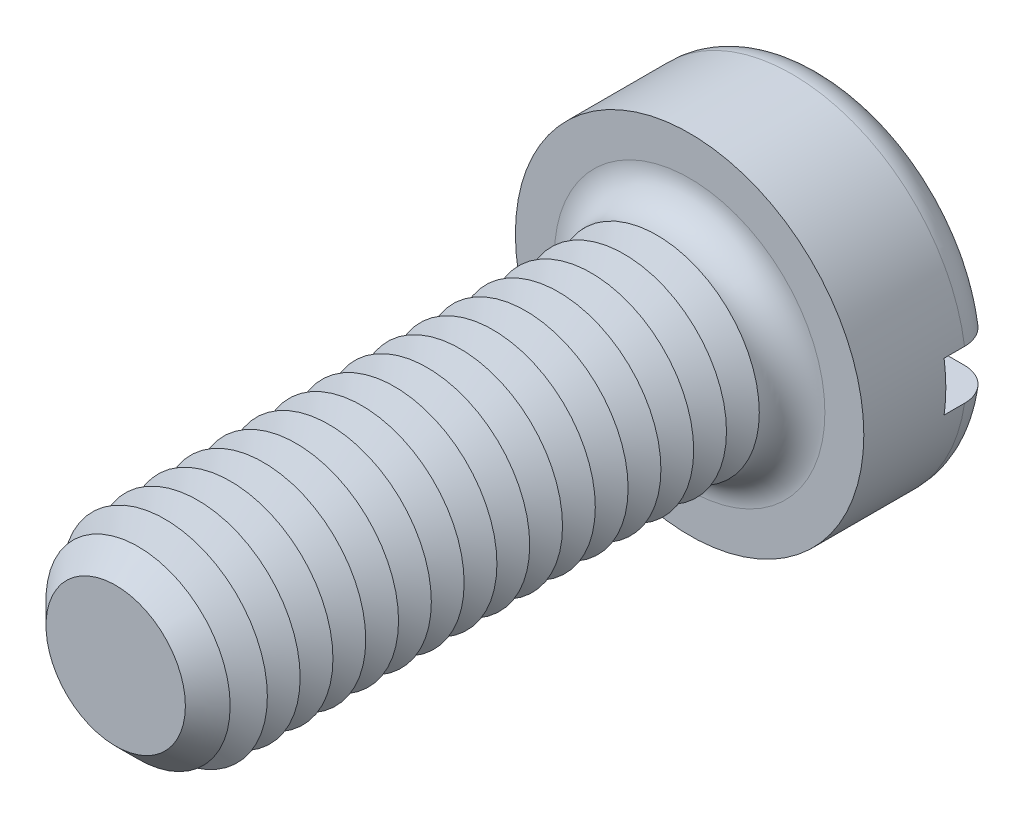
ISO-10303-21;
HEADER;
FILE_DESCRIPTION(('STEP AP214'),'2;1');
FILE_NAME('part.step','',(''),(''),'','','');
FILE_SCHEMA(('AUTOMOTIVE_DESIGN { 1 0 10303 214 1 1 1 1 }'));
ENDSEC;
DATA;
#1=APPLICATION_CONTEXT('core data for automotive mechanical design processes');
#2=APPLICATION_PROTOCOL_DEFINITION('international standard','automotive_design',2000,#1);
#3=PRODUCT_CONTEXT('',#1,'mechanical');
#4=PRODUCT('Part','Part','',(#3));
#5=PRODUCT_RELATED_PRODUCT_CATEGORY('part','',(#4));
#6=PRODUCT_DEFINITION_FORMATION('','',#4);
#7=PRODUCT_DEFINITION_CONTEXT('part definition',#1,'design');
#8=PRODUCT_DEFINITION('design','',#6,#7);
#9=PRODUCT_DEFINITION_SHAPE('','',#8);
#10=(LENGTH_UNIT() NAMED_UNIT(*) SI_UNIT(.MILLI.,.METRE.));
#11=(NAMED_UNIT(*) PLANE_ANGLE_UNIT() SI_UNIT($,.RADIAN.));
#12=(NAMED_UNIT(*) SI_UNIT($,.STERADIAN.) SOLID_ANGLE_UNIT());
#13=UNCERTAINTY_MEASURE_WITH_UNIT(LENGTH_MEASURE(1.E-05),#10,'distance_accuracy_value','');
#14=(GEOMETRIC_REPRESENTATION_CONTEXT(3) GLOBAL_UNCERTAINTY_ASSIGNED_CONTEXT((#13)) GLOBAL_UNIT_ASSIGNED_CONTEXT((#10,
#11,#12)) REPRESENTATION_CONTEXT('',''));
#15=CARTESIAN_POINT('',(0.,0.,0.));
#16=DIRECTION('',(0.,0.,1.));
#17=DIRECTION('',(1.,0.,0.));
#18=AXIS2_PLACEMENT_3D('',#15,#16,#17);
#19=CARTESIAN_POINT('',(0.,0.,-3.3));
#20=DIRECTION('',(0.,0.,1.));
#21=DIRECTION('',(1.,0.,0.));
#22=AXIS2_PLACEMENT_3D('',#19,#20,#21);
#23=PLANE('',#22);
#24=CARTESIAN_POINT('',(0.,0.,-3.3));
#25=DIRECTION('',(0.,0.,1.));
#26=DIRECTION('',(1.,0.,0.));
#27=AXIS2_PLACEMENT_3D('',#24,#25,#26);
#28=CIRCLE('',#27,3.45);
#29=CARTESIAN_POINT('',(-3.39742549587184,0.6,-3.3));
#30=VERTEX_POINT('',#29);
#31=CARTESIAN_POINT('',(3.39742549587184,0.6,-3.3));
#32=VERTEX_POINT('',#31);
#33=EDGE_CURVE('E116',#30,#32,#28,.F.);
#34=ORIENTED_EDGE('',*,*,#33,.T.);
#35=DIRECTION('',(1.,0.,0.));
#36=VECTOR('',#35,1.);
#37=CARTESIAN_POINT('',(-4.25,0.600000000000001,-3.3));
#38=LINE('',#37,#36);
#39=EDGE_CURVE('E111',#30,#32,#38,.T.);
#40=ORIENTED_EDGE('',*,*,#39,.F.);
#41=EDGE_LOOP('',(#34,#40));
#42=FACE_BOUND('',#41,.T.);
#43=ADVANCED_FACE('F39',(#42),#23,.F.);
#44=CARTESIAN_POINT('',(0.,0.,-2.5));
#45=DIRECTION('',(0.,0.,1.));
#46=DIRECTION('',(1.,0.,0.));
#47=AXIS2_PLACEMENT_3D('',#44,#45,#46);
#48=TOROIDAL_SURFACE('',#47,3.45,0.8);
#49=CARTESIAN_POINT('',(-4.06369072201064,0.600000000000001,-2.95537828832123));
#50=CARTESIAN_POINT('',(-4.03774340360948,0.600000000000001,-2.99245078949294));
#51=CARTESIAN_POINT('',(-4.00861849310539,0.600000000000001,-3.02734231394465));
#52=CARTESIAN_POINT('',(-3.94488199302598,0.600000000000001,-3.0917502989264));
#53=CARTESIAN_POINT('',(-3.91026320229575,0.600000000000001,-3.12125959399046));
#54=CARTESIAN_POINT('',(-3.83660561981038,0.600000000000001,-3.17403695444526));
#55=CARTESIAN_POINT('',(-3.79757117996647,0.6,-3.19731109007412));
#56=CARTESIAN_POINT('',(-3.71618817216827,0.6,-3.23703443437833));
#57=CARTESIAN_POINT('',(-3.67384041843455,0.6,-3.25348531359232));
#58=CARTESIAN_POINT('',(-3.58661930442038,0.6,-3.2792758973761));
#59=CARTESIAN_POINT('',(-3.54172669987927,0.6,-3.288550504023));
#60=CARTESIAN_POINT('',(-3.45102322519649,0.6,-3.29952632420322));
#61=CARTESIAN_POINT('',(-3.40521225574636,0.6,-3.30122671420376));
#62=CARTESIAN_POINT('',(-3.31340831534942,0.6,-3.29701196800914));
#63=CARTESIAN_POINT('',(-3.26741940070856,0.6,-3.29100823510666));
#64=CARTESIAN_POINT('',(-3.17708556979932,0.6,-3.27141469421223));
#65=CARTESIAN_POINT('',(-3.13274074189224,0.6,-3.25782447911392));
#66=CARTESIAN_POINT('',(-3.0466814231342,0.6,-3.22332549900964));
#67=CARTESIAN_POINT('',(-3.00498444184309,0.6,-3.20237301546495));
#68=CARTESIAN_POINT('',(-2.92572251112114,0.6,-3.15372961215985));
#69=CARTESIAN_POINT('',(-2.88815755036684,0.6,-3.12603871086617));
#70=CARTESIAN_POINT('',(-2.81847654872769,0.6,-3.06483322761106));
#71=CARTESIAN_POINT('',(-2.78633186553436,0.6,-3.03135128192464));
#72=CARTESIAN_POINT('',(-2.72824805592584,0.6,-2.95937651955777));
#73=CARTESIAN_POINT('',(-2.70230829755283,0.6,-2.92088421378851));
#74=CARTESIAN_POINT('',(-2.65791262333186,0.6,-2.84074227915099));
#75=CARTESIAN_POINT('',(-2.63932560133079,0.6,-2.79916531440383));
#76=CARTESIAN_POINT('',(-2.60958432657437,0.6,-2.7134333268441));
#77=CARTESIAN_POINT('',(-2.59842889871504,0.6,-2.66927871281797));
#78=CARTESIAN_POINT('',(-2.58411140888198,0.6,-2.58073966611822));
#79=CARTESIAN_POINT('',(-2.58077086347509,0.6,-2.5363840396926));
#80=CARTESIAN_POINT('',(-2.58167367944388,0.6,-2.44775208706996));
#81=CARTESIAN_POINT('',(-2.58591644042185,0.6,-2.40347575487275));
#82=CARTESIAN_POINT('',(-2.60175154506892,0.6,-2.31675105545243));
#83=CARTESIAN_POINT('',(-2.61326489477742,0.6,-2.27428821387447));
#84=CARTESIAN_POINT('',(-2.6431863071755,0.6,-2.19186794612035));
#85=CARTESIAN_POINT('',(-2.66159465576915,0.6,-2.15191062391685));
#86=CARTESIAN_POINT('',(-2.70494650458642,0.6,-2.07517696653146));
#87=CARTESIAN_POINT('',(-2.72995486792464,0.6,-2.03843731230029));
#88=CARTESIAN_POINT('',(-2.7856570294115,0.6,-1.96955746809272));
#89=CARTESIAN_POINT('',(-2.81635145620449,0.6,-1.93741778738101));
#90=CARTESIAN_POINT('',(-2.88329572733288,0.6,-1.87788048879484));
#91=CARTESIAN_POINT('',(-2.91965530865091,0.6,-1.85060625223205));
#92=CARTESIAN_POINT('',(-2.9963658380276,0.6,-1.80241044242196));
#93=CARTESIAN_POINT('',(-3.03671721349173,0.6,-1.78148955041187));
#94=CARTESIAN_POINT('',(-3.12111125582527,0.6,-1.74619829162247));
#95=CARTESIAN_POINT('',(-3.16521020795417,0.6,-1.73196239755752));
#96=CARTESIAN_POINT('',(-3.25516487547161,0.6,-1.71103773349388));
#97=CARTESIAN_POINT('',(-3.30102068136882,0.6,-1.70434935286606));
#98=CARTESIAN_POINT('',(-3.39352689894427,0.6,-1.69870104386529));
#99=CARTESIAN_POINT('',(-3.44018061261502,0.6,-1.69979487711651));
#100=CARTESIAN_POINT('',(-3.53263583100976,0.6,-1.70983959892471));
#101=CARTESIAN_POINT('',(-3.57843734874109,0.6,-1.71879036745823));
#102=CARTESIAN_POINT('',(-3.66763544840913,0.6,-1.74426972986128));
#103=CARTESIAN_POINT('',(-3.71104292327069,0.6,-1.76076015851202));
#104=CARTESIAN_POINT('',(-3.79442616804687,0.6,-1.80087686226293));
#105=CARTESIAN_POINT('',(-3.83440212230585,0.600000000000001,-1.82450275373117));
#106=CARTESIAN_POINT('',(-3.90929765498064,0.600000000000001,-1.87793548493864));
#107=CARTESIAN_POINT('',(-3.94426963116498,0.600000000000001,-1.90766887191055));
#108=CARTESIAN_POINT('',(-4.00864839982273,0.600000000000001,-1.9726503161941));
#109=CARTESIAN_POINT('',(-4.03805555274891,0.600000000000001,-2.00789801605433));
#110=CARTESIAN_POINT('',(-4.09009460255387,0.600000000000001,-2.08244463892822));
#111=CARTESIAN_POINT('',(-4.11280448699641,0.600000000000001,-2.12168912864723));
#112=CARTESIAN_POINT('',(-4.15124086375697,0.600000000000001,-2.2034588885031));
#113=CARTESIAN_POINT('',(-4.16696802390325,0.600000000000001,-2.24598384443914));
#114=CARTESIAN_POINT('',(-4.19085131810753,0.600000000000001,-2.33267862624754));
#115=CARTESIAN_POINT('',(-4.19907708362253,0.600000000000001,-2.37682928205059));
#116=CARTESIAN_POINT('',(-4.2079638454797,0.600000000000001,-2.46589754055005));
#117=CARTESIAN_POINT('',(-4.20862315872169,0.600000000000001,-2.51081531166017));
#118=CARTESIAN_POINT('',(-4.20236829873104,0.600000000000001,-2.59993343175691));
#119=CARTESIAN_POINT('',(-4.19548454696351,0.600000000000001,-2.64413593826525));
#120=CARTESIAN_POINT('',(-4.17439924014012,0.600000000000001,-2.73071930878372));
#121=CARTESIAN_POINT('',(-4.16020675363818,0.600000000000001,-2.77310235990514));
#122=CARTESIAN_POINT('',(-4.1318825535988,0.600000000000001,-2.83880495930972));
#123=CARTESIAN_POINT('',(-4.11991183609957,0.600000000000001,-2.86307959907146));
#124=CARTESIAN_POINT('',(-4.09356927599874,0.600000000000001,-2.91028856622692));
#125=CARTESIAN_POINT('',(-4.07919744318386,0.600000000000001,-2.9332228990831));
#126=CARTESIAN_POINT('',(-4.06369072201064,0.600000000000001,-2.95537828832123));
#127=B_SPLINE_CURVE_WITH_KNOTS('',3,(#49,#50,#51,#52,#53,#54,#55,#56,#57,#58,#59,#60,#61,#62,
#63,#64,#65,#66,#67,#68,#69,#70,#71,#72,#73,#74,#75,#76,#77,#78,#79,#80,#81,#82,#83,#84,#85,#86,
#87,#88,#89,#90,#91,#92,#93,#94,#95,#96,#97,#98,#99,#100,#101,#102,#103,#104,#105,#106,#107,
#108,#109,#110,#111,#112,#113,#114,#115,#116,#117,#118,#119,#120,#121,#122,#123,#124,#125,#126),
.UNSPECIFIED.,.T.,.F.,(4,2,2,2,2,2,2,2,2,2,2,2,2,2,2,2,2,2,2,2,2,2,2,2,2,2,2,2,2,2,2,2,2,2,2,2,
2,2,4),(0.,0.13565225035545,0.271483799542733,0.407182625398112,0.542848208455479,
0.679730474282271,0.816627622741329,0.955113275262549,1.09360635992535,1.23293614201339,
1.37226554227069,1.51083389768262,1.64938813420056,1.78534653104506,1.92128342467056,
2.0540840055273,2.18687407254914,2.31824564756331,2.44962267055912,2.58234229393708,
2.71507659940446,2.85080630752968,2.98655056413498,3.12491938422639,3.26329534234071,
3.40262816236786,3.54195885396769,3.68059194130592,3.81921757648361,3.95626453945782,
4.09330262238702,4.2286754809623,4.36403538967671,4.49812564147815,4.63224572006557,
4.76582687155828,4.89924267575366,4.98031194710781,5.0613808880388),.UNSPECIFIED.);
#128=CARTESIAN_POINT('',(-4.20743389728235,0.600000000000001,-2.50000000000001));
#129=VERTEX_POINT('',#128);
#130=EDGE_CURVE('E313',#129,#30,#127,.T.);
#131=ORIENTED_EDGE('',*,*,#130,.F.);
#132=CARTESIAN_POINT('',(0.,0.,-2.5));
#133=DIRECTION('',(0.,0.,1.));
#134=DIRECTION('',(1.,0.,0.));
#135=AXIS2_PLACEMENT_3D('',#132,#133,#134);
#136=CIRCLE('',#135,4.25);
#137=CARTESIAN_POINT('',(4.20743389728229,0.599999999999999,-2.5));
#138=VERTEX_POINT('',#137);
#139=EDGE_CURVE('E125',#138,#129,#136,.T.);
#140=ORIENTED_EDGE('',*,*,#139,.F.);
#141=CARTESIAN_POINT('',(2.63947327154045,0.6,-2.79608831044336));
#142=CARTESIAN_POINT('',(2.65655980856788,0.6,-2.83790320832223));
#143=CARTESIAN_POINT('',(2.67725642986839,0.6,-2.87828303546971));
#144=CARTESIAN_POINT('',(2.72519250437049,0.6,-2.95500233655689));
#145=CARTESIAN_POINT('',(2.75244152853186,0.6,-2.9913357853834));
#146=CARTESIAN_POINT('',(2.81257938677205,0.6,-3.05889430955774));
#147=CARTESIAN_POINT('',(2.84545995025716,0.6,-3.09012674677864));
#148=CARTESIAN_POINT('',(2.91591143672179,0.6,-3.14672620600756));
#149=CARTESIAN_POINT('',(2.95348119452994,0.6,-3.17209468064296));
#150=CARTESIAN_POINT('',(3.03291143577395,0.6,-3.21669611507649));
#151=CARTESIAN_POINT('',(3.07483186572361,0.6,-3.23582234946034));
#152=CARTESIAN_POINT('',(3.16126659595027,0.6,-3.26686062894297));
#153=CARTESIAN_POINT('',(3.2057811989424,0.6,-3.27877183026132));
#154=CARTESIAN_POINT('',(3.29669878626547,0.6,-3.29514603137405));
#155=CARTESIAN_POINT('',(3.34311773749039,0.6,-3.29952056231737));
#156=CARTESIAN_POINT('',(3.43603189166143,0.6,-3.30040472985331));
#157=CARTESIAN_POINT('',(3.48252709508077,0.6,-3.29691431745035));
#158=CARTESIAN_POINT('',(3.57420049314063,0.6,-3.28214240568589));
#159=CARTESIAN_POINT('',(3.61938038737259,0.6,-3.27087147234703));
#160=CARTESIAN_POINT('',(3.70717477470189,0.6,-3.24082890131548));
#161=CARTESIAN_POINT('',(3.74978938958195,0.6,-3.22205762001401));
#162=CARTESIAN_POINT('',(3.83078828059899,0.6,-3.17773607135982));
#163=CARTESIAN_POINT('',(3.86921015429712,0.599999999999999,-3.15225453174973));
#164=CARTESIAN_POINT('',(3.94116038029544,0.599999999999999,-3.09512672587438));
#165=CARTESIAN_POINT('',(3.9746890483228,0.599999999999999,-3.06348085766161));
#166=CARTESIAN_POINT('',(4.03545911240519,0.599999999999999,-2.99534640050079));
#167=CARTESIAN_POINT('',(4.06277344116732,0.599999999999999,-2.95892285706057));
#168=CARTESIAN_POINT('',(4.11082191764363,0.599999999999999,-2.88196698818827));
#169=CARTESIAN_POINT('',(4.13155647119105,0.599999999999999,-2.84143491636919));
#170=CARTESIAN_POINT('',(4.16563480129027,0.599999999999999,-2.75787550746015));
#171=CARTESIAN_POINT('',(4.1790544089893,0.599999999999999,-2.71487908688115));
#172=CARTESIAN_POINT('',(4.19843340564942,0.599999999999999,-2.62723691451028));
#173=CARTESIAN_POINT('',(4.20439310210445,0.599999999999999,-2.58259123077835));
#174=CARTESIAN_POINT('',(4.2086595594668,0.599999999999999,-2.49321831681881));
#175=CARTESIAN_POINT('',(4.20701422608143,0.599999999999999,-2.4484933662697));
#176=CARTESIAN_POINT('',(4.1962295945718,0.599999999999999,-2.35995704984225));
#177=CARTESIAN_POINT('',(4.18709040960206,0.599999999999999,-2.31614567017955));
#178=CARTESIAN_POINT('',(4.16160290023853,0.599999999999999,-2.23072100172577));
#179=CARTESIAN_POINT('',(4.14526169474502,0.599999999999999,-2.18910558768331));
#180=CARTESIAN_POINT('',(4.10585410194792,0.599999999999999,-2.10919238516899));
#181=CARTESIAN_POINT('',(4.08278762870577,0.599999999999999,-2.07089463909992));
#182=CARTESIAN_POINT('',(4.030487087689,0.599999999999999,-1.99851484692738));
#183=CARTESIAN_POINT('',(4.00122628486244,0.599999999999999,-1.9644521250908));
#184=CARTESIAN_POINT('',(3.93744772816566,0.599999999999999,-1.90166877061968));
#185=CARTESIAN_POINT('',(3.90292977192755,0.599999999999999,-1.87294834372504));
#186=CARTESIAN_POINT('',(3.82928727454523,0.599999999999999,-1.82137853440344));
#187=CARTESIAN_POINT('',(3.79012374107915,0.6,-1.79858484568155));
#188=CARTESIAN_POINT('',(3.70856025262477,0.6,-1.75980712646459));
#189=CARTESIAN_POINT('',(3.66616010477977,0.6,-1.74382350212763));
#190=CARTESIAN_POINT('',(3.57878495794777,0.6,-1.71891499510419));
#191=CARTESIAN_POINT('',(3.53378519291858,0.6,-1.71007699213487));
#192=CARTESIAN_POINT('',(3.44294322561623,0.6,-1.69998722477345));
#193=CARTESIAN_POINT('',(3.3971009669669,0.6,-1.69873596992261));
#194=CARTESIAN_POINT('',(3.30531297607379,0.6,-1.70385439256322));
#195=CARTESIAN_POINT('',(3.25937213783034,0.6,-1.71031204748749));
#196=CARTESIAN_POINT('',(3.1692099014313,0.6,-1.73080107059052));
#197=CARTESIAN_POINT('',(3.12498860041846,0.6,-1.74483286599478));
#198=CARTESIAN_POINT('',(3.03926209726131,0.6,-1.78018941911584));
#199=CARTESIAN_POINT('',(2.99777407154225,0.6,-1.80155586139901));
#200=CARTESIAN_POINT('',(2.91899881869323,0.6,-1.85098881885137));
#201=CARTESIAN_POINT('',(2.88171158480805,0.6,-1.8790553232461));
#202=CARTESIAN_POINT('',(2.81266124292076,0.6,-1.94094884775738));
#203=CARTESIAN_POINT('',(2.78086710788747,0.6,-1.97474122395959));
#204=CARTESIAN_POINT('',(2.72353615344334,0.6,-2.0472724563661));
#205=CARTESIAN_POINT('',(2.69799841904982,0.6,-2.08601058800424));
#206=CARTESIAN_POINT('',(2.65444718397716,0.6,-2.16655019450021));
#207=CARTESIAN_POINT('',(2.63629889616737,0.6,-2.20827875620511));
#208=CARTESIAN_POINT('',(2.60744942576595,0.6,-2.29424821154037));
#209=CARTESIAN_POINT('',(2.59674901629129,0.6,-2.33848936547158));
#210=CARTESIAN_POINT('',(2.5833312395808,0.6,-2.42714258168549));
#211=CARTESIAN_POINT('',(2.58043995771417,0.6,-2.47152848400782));
#212=CARTESIAN_POINT('',(2.58224493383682,0.6,-2.56010574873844));
#213=CARTESIAN_POINT('',(2.58693104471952,0.6,-2.60429729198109));
#214=CARTESIAN_POINT('',(2.60020046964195,0.6,-2.67311978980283));
#215=CARTESIAN_POINT('',(2.60635343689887,0.6,-2.69824441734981));
#216=CARTESIAN_POINT('',(2.62110140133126,0.6,-2.74776540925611));
#217=CARTESIAN_POINT('',(2.62969634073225,0.6,-2.77216179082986));
#218=CARTESIAN_POINT('',(2.63947327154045,0.6,-2.79608831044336));
#219=B_SPLINE_CURVE_WITH_KNOTS('',3,(#141,#142,#143,#144,#145,#146,#147,#148,#149,#150,#151,
#152,#153,#154,#155,#156,#157,#158,#159,#160,#161,#162,#163,#164,#165,#166,#167,#168,#169,#170,
#171,#172,#173,#174,#175,#176,#177,#178,#179,#180,#181,#182,#183,#184,#185,#186,#187,#188,#189,
#190,#191,#192,#193,#194,#195,#196,#197,#198,#199,#200,#201,#202,#203,#204,#205,#206,#207,#208,
#209,#210,#211,#212,#213,#214,#215,#216,#217,#218),.UNSPECIFIED.,.T.,.F.,(4,2,2,2,2,2,2,2,2,2,2,
2,2,2,2,2,2,2,2,2,2,2,2,2,2,2,2,2,2,2,2,2,2,2,2,2,2,2,4),(0.,0.135416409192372,
0.271031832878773,0.406449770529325,0.541834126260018,0.679424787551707,0.817031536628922,
0.956242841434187,1.09545501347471,1.23447850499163,1.37349539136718,1.51114036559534,
1.64877645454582,1.78470267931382,1.92062051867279,2.05510117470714,2.1895762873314,
2.32320547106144,2.45683263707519,2.59032801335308,2.72382509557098,2.85791055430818,
2.99200117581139,3.12730969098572,3.26262627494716,3.39956435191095,3.53651162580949,
3.67503685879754,3.81356990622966,3.95290367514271,4.09223721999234,4.23075602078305,
4.36925455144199,4.50509949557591,4.6409585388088,4.77376594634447,4.90639565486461,
4.98388287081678,5.06136825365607),.UNSPECIFIED.);
#220=EDGE_CURVE('E315',#32,#138,#219,.T.);
#221=ORIENTED_EDGE('',*,*,#220,.F.);
#222=ORIENTED_EDGE('',*,*,#33,.F.);
#223=EDGE_LOOP('',(#131,#140,#221,#222));
#224=FACE_BOUND('',#223,.T.);
#225=ADVANCED_FACE('F297',(#224),#48,.T.);
#226=CARTESIAN_POINT('',(0.,0.,-3.3));
#227=DIRECTION('',(0.,0.,1.));
#228=DIRECTION('',(1.,0.,0.));
#229=AXIS2_PLACEMENT_3D('',#226,#227,#228);
#230=CYLINDRICAL_SURFACE('',#229,4.25);
#231=DIRECTION('',(0.,0.,1.));
#232=VECTOR('',#231,1.);
#233=CARTESIAN_POINT('',(4.20743389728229,0.599999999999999,-3.3));
#234=LINE('',#233,#232);
#235=CARTESIAN_POINT('',(4.20743389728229,0.599999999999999,-2.));
#236=VERTEX_POINT('',#235);
#237=EDGE_CURVE('E331',#138,#236,#234,.T.);
#238=ORIENTED_EDGE('',*,*,#237,.F.);
#239=ORIENTED_EDGE('',*,*,#139,.T.);
#240=DIRECTION('',(0.,0.,1.));
#241=VECTOR('',#240,1.);
#242=CARTESIAN_POINT('',(-4.20743389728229,0.600000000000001,-3.3));
#243=LINE('',#242,#241);
#244=CARTESIAN_POINT('',(-4.20743389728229,0.600000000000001,-2.));
#245=VERTEX_POINT('',#244);
#246=EDGE_CURVE('E63',#245,#129,#243,.F.);
#247=ORIENTED_EDGE('',*,*,#246,.F.);
#248=CARTESIAN_POINT('',(0.,0.,-2.));
#249=DIRECTION('',(0.,0.,-1.));
#250=DIRECTION('',(-1.,0.,0.));
#251=AXIS2_PLACEMENT_3D('',#248,#249,#250);
#252=CIRCLE('',#251,4.25);
#253=CARTESIAN_POINT('',(-4.20743389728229,-0.599999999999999,-2.));
#254=VERTEX_POINT('',#253);
#255=EDGE_CURVE('E43',#245,#254,#252,.F.);
#256=ORIENTED_EDGE('',*,*,#255,.T.);
#257=DIRECTION('',(0.,0.,1.));
#258=VECTOR('',#257,1.);
#259=CARTESIAN_POINT('',(-4.20743389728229,-0.599999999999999,-3.3));
#260=LINE('',#259,#258);
#261=CARTESIAN_POINT('',(-4.20743389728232,-0.599999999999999,-2.5));
#262=VERTEX_POINT('',#261);
#263=EDGE_CURVE('E328',#262,#254,#260,.T.);
#264=ORIENTED_EDGE('',*,*,#263,.F.);
#265=CARTESIAN_POINT('',(4.20743389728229,-0.600000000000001,-2.5));
#266=VERTEX_POINT('',#265);
#267=EDGE_CURVE('E127',#262,#266,#136,.T.);
#268=ORIENTED_EDGE('',*,*,#267,.T.);
#269=DIRECTION('',(0.,0.,1.));
#270=VECTOR('',#269,1.);
#271=CARTESIAN_POINT('',(4.20743389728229,-0.600000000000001,-3.3));
#272=LINE('',#271,#270);
#273=CARTESIAN_POINT('',(4.20743389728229,-0.600000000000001,-2.));
#274=VERTEX_POINT('',#273);
#275=EDGE_CURVE('E55',#274,#266,#272,.F.);
#276=ORIENTED_EDGE('',*,*,#275,.F.);
#277=EDGE_CURVE('E11',#274,#236,#252,.F.);
#278=ORIENTED_EDGE('',*,*,#277,.T.);
#279=EDGE_LOOP('',(#238,#239,#247,#256,#264,#268,#276,#278));
#280=FACE_BOUND('',#279,.T.);
#281=CARTESIAN_POINT('',(0.,0.,0.));
#282=DIRECTION('',(0.,0.,1.));
#283=DIRECTION('',(1.,0.,0.));
#284=AXIS2_PLACEMENT_3D('',#281,#282,#283);
#285=CIRCLE('',#284,4.25);
#286=CARTESIAN_POINT('',(4.25,0.,0.));
#287=VERTEX_POINT('',#286);
#288=EDGE_CURVE('E334',#287,#287,#285,.T.);
#289=ORIENTED_EDGE('',*,*,#288,.F.);
#290=EDGE_LOOP('',(#289));
#291=FACE_BOUND('',#290,.T.);
#292=ADVANCED_FACE('F293',(#280,#291),#230,.T.);
#293=CARTESIAN_POINT('',(3.39742549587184,-0.6,-3.3));
#294=VERTEX_POINT('',#293);
#295=CARTESIAN_POINT('',(-3.39742549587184,-0.6,-3.3));
#296=VERTEX_POINT('',#295);
#297=EDGE_CURVE('E109',#294,#296,#28,.F.);
#298=ORIENTED_EDGE('',*,*,#297,.T.);
#299=DIRECTION('',(-1.,0.,0.));
#300=VECTOR('',#299,1.);
#301=CARTESIAN_POINT('',(-4.25,-0.599999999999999,-3.3));
#302=LINE('',#301,#300);
#303=EDGE_CURVE('E96',#294,#296,#302,.T.);
#304=ORIENTED_EDGE('',*,*,#303,.F.);
#305=EDGE_LOOP('',(#298,#304));
#306=FACE_BOUND('',#305,.T.);
#307=ADVANCED_FACE('F108',(#306),#23,.F.);
#308=CARTESIAN_POINT('',(0.,0.,0.));
#309=DIRECTION('',(0.,0.,1.));
#310=DIRECTION('',(1.,0.,0.));
#311=AXIS2_PLACEMENT_3D('',#308,#309,#310);
#312=PLANE('',#311);
#313=CARTESIAN_POINT('',(0.,0.,0.));
#314=DIRECTION('',(0.,0.,1.));
#315=DIRECTION('',(1.,0.,0.));
#316=AXIS2_PLACEMENT_3D('',#313,#314,#315);
#317=CIRCLE('',#316,3.3);
#318=CARTESIAN_POINT('',(3.3,0.,0.));
#319=VERTEX_POINT('',#318);
#320=EDGE_CURVE('E115',#319,#319,#317,.F.);
#321=ORIENTED_EDGE('',*,*,#320,.T.);
#322=EDGE_LOOP('',(#321));
#323=FACE_BOUND('',#322,.T.);
#324=ORIENTED_EDGE('',*,*,#288,.T.);
#325=EDGE_LOOP('',(#324));
#326=FACE_BOUND('',#325,.T.);
#327=ADVANCED_FACE('F292',(#323,#326),#312,.T.);
#328=CARTESIAN_POINT('',(-4.06369072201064,-0.599999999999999,-2.95537828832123));
#329=CARTESIAN_POINT('',(-4.08928577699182,-0.599999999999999,-2.91880204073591));
#330=CARTESIAN_POINT('',(-4.11182555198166,-0.599999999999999,-2.88005030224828));
#331=CARTESIAN_POINT('',(-4.15010404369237,-0.599999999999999,-2.79928452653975));
#332=CARTESIAN_POINT('',(-4.16583526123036,-0.599999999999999,-2.75726695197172));
#333=CARTESIAN_POINT('',(-4.19000286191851,-0.599999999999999,-2.67118996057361));
#334=CARTESIAN_POINT('',(-4.19844101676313,-0.599999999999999,-2.62713104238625));
#335=CARTESIAN_POINT('',(-4.20777174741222,-0.599999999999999,-2.53823222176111));
#336=CARTESIAN_POINT('',(-4.20866608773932,-0.599999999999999,-2.49339250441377));
#337=CARTESIAN_POINT('',(-4.20289683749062,-0.599999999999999,-2.40433856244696));
#338=CARTESIAN_POINT('',(-4.19625607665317,-0.599999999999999,-2.36012285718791));
#339=CARTESIAN_POINT('',(-4.17565084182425,-0.599999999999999,-2.27343166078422));
#340=CARTESIAN_POINT('',(-4.16168615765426,-0.599999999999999,-2.23095621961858));
#341=CARTESIAN_POINT('',(-4.12683188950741,-0.599999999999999,-2.14890863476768));
#342=CARTESIAN_POINT('',(-4.10593663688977,-0.599999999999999,-2.10933890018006));
#343=CARTESIAN_POINT('',(-4.05783763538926,-0.599999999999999,-2.03424145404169));
#344=CARTESIAN_POINT('',(-4.03063375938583,-0.599999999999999,-1.99871382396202));
#345=CARTESIAN_POINT('',(-3.97052236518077,-0.599999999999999,-1.93246905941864));
#346=CARTESIAN_POINT('',(-3.93758114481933,-0.599999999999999,-1.90178251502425));
#347=CARTESIAN_POINT('',(-3.86706007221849,-0.599999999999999,-1.84630837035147));
#348=CARTESIAN_POINT('',(-3.82948001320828,-0.6,-1.82152103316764));
#349=CARTESIAN_POINT('',(-3.75033766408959,-0.6,-1.77826995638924));
#350=CARTESIAN_POINT('',(-3.70873831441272,-0.6,-1.7598740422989));
#351=CARTESIAN_POINT('',(-3.62306661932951,-0.6,-1.73023196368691));
#352=CARTESIAN_POINT('',(-3.57899411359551,-0.6,-1.71898626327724));
#353=CARTESIAN_POINT('',(-3.48904845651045,-0.6,-1.70382025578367));
#354=CARTESIAN_POINT('',(-3.44315982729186,-0.6,-1.69999172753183));
#355=CARTESIAN_POINT('',(-3.35138360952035,-0.6,-1.7000083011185));
#356=CARTESIAN_POINT('',(-3.30549602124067,-0.6,-1.70385391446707));
#357=CARTESIAN_POINT('',(-3.21452492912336,-0.6,-1.71917227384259));
#358=CARTESIAN_POINT('',(-3.16945455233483,-0.6,-1.73072307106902));
#359=CARTESIAN_POINT('',(-3.08188104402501,-0.6,-1.76120640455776));
#360=CARTESIAN_POINT('',(-3.0393780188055,-0.6,-1.78013924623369));
#361=CARTESIAN_POINT('',(-2.95805296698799,-0.6,-1.82493384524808));
#362=CARTESIAN_POINT('',(-2.9192403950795,-0.6,-1.85081278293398));
#363=CARTESIAN_POINT('',(-2.84656695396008,-0.6,-1.90878317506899));
#364=CARTESIAN_POINT('',(-2.81270591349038,-0.6,-1.94087441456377));
#365=CARTESIAN_POINT('',(-2.75131050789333,-0.6,-2.01002500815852));
#366=CARTESIAN_POINT('',(-2.72371339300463,-0.6,-2.04702860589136));
#367=CARTESIAN_POINT('',(-2.67528742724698,-0.6,-2.12522869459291));
#368=CARTESIAN_POINT('',(-2.65445765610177,-0.6,-2.1664246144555));
#369=CARTESIAN_POINT('',(-2.62065354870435,-0.6,-2.25087266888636));
#370=CARTESIAN_POINT('',(-2.60751663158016,-0.6,-2.29405971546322));
#371=CARTESIAN_POINT('',(-2.58885106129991,-0.6,-2.38204659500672));
#372=CARTESIAN_POINT('',(-2.58332131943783,-0.6,-2.42684619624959));
#373=CARTESIAN_POINT('',(-2.58009777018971,-0.6,-2.51580379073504));
#374=CARTESIAN_POINT('',(-2.58224575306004,-0.6,-2.55995612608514));
#375=CARTESIAN_POINT('',(-2.59395205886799,-0.6,-2.64726495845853));
#376=CARTESIAN_POINT('',(-2.60351013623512,-0.6,-2.69042148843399));
#377=CARTESIAN_POINT('',(-2.62967159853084,-0.6,-2.77438771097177));
#378=CARTESIAN_POINT('',(-2.64625243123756,-0.6,-2.81520444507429));
#379=CARTESIAN_POINT('',(-2.68592348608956,-0.6,-2.89353901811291));
#380=CARTESIAN_POINT('',(-2.70901418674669,-0.6,-2.9310566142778));
#381=CARTESIAN_POINT('',(-2.7614318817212,-0.6,-3.00240040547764));
#382=CARTESIAN_POINT('',(-2.79085487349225,-0.6,-3.03615603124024));
#383=CARTESIAN_POINT('',(-2.85483456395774,-0.6,-3.09838834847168));
#384=CARTESIAN_POINT('',(-2.88939187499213,-0.6,-3.12686440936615));
#385=CARTESIAN_POINT('',(-2.96351967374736,-0.6,-3.17841283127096));
#386=CARTESIAN_POINT('',(-3.00318741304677,-0.6,-3.20134539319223));
#387=CARTESIAN_POINT('',(-3.08576649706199,-0.6,-3.24034364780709));
#388=CARTESIAN_POINT('',(-3.12867814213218,-0.6,-3.25640870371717));
#389=CARTESIAN_POINT('',(-3.21724048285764,-0.6,-3.28143816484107));
#390=CARTESIAN_POINT('',(-3.26292314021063,-0.6,-3.29028963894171));
#391=CARTESIAN_POINT('',(-3.35512527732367,-0.6,-3.30021681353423));
#392=CARTESIAN_POINT('',(-3.40164474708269,-0.6,-3.30129260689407));
#393=CARTESIAN_POINT('',(-3.49429978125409,-0.6,-3.29560589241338));
#394=CARTESIAN_POINT('',(-3.54043436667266,-0.6,-3.28882735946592));
#395=CARTESIAN_POINT('',(-3.63090382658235,-0.6,-3.26755492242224));
#396=CARTESIAN_POINT('',(-3.67523831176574,-0.6,-3.25305935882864));
#397=CARTESIAN_POINT('',(-3.76046509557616,-0.6,-3.21686867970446));
#398=CARTESIAN_POINT('',(-3.80138087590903,-0.599999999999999,-3.1952288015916));
#399=CARTESIAN_POINT('',(-3.8788986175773,-0.599999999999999,-3.14531817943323));
#400=CARTESIAN_POINT('',(-3.91550599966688,-0.599999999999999,-3.11705590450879));
#401=CARTESIAN_POINT('',(-3.97074313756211,-0.599999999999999,-3.06628809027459));
#402=CARTESIAN_POINT('',(-3.99100743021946,-0.599999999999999,-3.04553102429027));
#403=CARTESIAN_POINT('',(-4.02917385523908,-0.599999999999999,-3.00194762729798));
#404=CARTESIAN_POINT('',(-4.04707600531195,-0.599999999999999,-2.97912131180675));
#405=CARTESIAN_POINT('',(-4.06369072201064,-0.599999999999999,-2.95537828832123));
#406=B_SPLINE_CURVE_WITH_KNOTS('',3,(#328,#329,#330,#331,#332,#333,#334,#335,#336,#337,#338,
#339,#340,#341,#342,#343,#344,#345,#346,#347,#348,#349,#350,#351,#352,#353,#354,#355,#356,#357,
#358,#359,#360,#361,#362,#363,#364,#365,#366,#367,#368,#369,#370,#371,#372,#373,#374,#375,#376,
#377,#378,#379,#380,#381,#382,#383,#384,#385,#386,#387,#388,#389,#390,#391,#392,#393,#394,#395,
#396,#397,#398,#399,#400,#401,#402,#403,#404,#405),.UNSPECIFIED.,.T.,.F.,(4,2,2,2,2,2,2,2,2,2,2,
2,2,2,2,2,2,2,2,2,2,2,2,2,2,2,2,2,2,2,2,2,2,2,2,2,2,2,4),(0.,0.133821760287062,
0.267790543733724,0.401726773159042,0.535631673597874,0.669131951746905,0.802636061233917,
0.936249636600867,1.06986590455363,1.2042952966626,1.3387306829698,1.47455198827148,
1.61038210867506,1.74788249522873,1.88539204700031,2.02431612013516,2.16324594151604,
2.30252260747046,2.4417944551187,2.57960263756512,2.71739207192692,2.85215325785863,
2.98689515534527,3.11887666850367,3.25085380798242,3.38241030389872,3.51397647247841,
3.64769871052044,3.78143690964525,3.91826005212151,4.05509587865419,4.19403485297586,
4.33297216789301,4.47219345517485,4.61144469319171,4.74964356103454,4.887666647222,
4.97453605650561,5.06140481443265),.UNSPECIFIED.);
#407=EDGE_CURVE('E103',#296,#262,#406,.T.);
#408=ORIENTED_EDGE('',*,*,#407,.F.);
#409=ORIENTED_EDGE('',*,*,#297,.F.);
#410=CARTESIAN_POINT('',(2.63947327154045,-0.6,-2.79608831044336));
#411=CARTESIAN_POINT('',(2.62285766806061,-0.6,-2.75541510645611));
#412=CARTESIAN_POINT('',(2.60963282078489,-0.6,-2.71332585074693));
#413=CARTESIAN_POINT('',(2.59042394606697,-0.6,-2.62749460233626));
#414=CARTESIAN_POINT('',(2.58444686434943,-0.6,-2.58375106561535));
#415=CARTESIAN_POINT('',(2.57995287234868,-0.6,-2.49588524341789));
#416=CARTESIAN_POINT('',(2.58143477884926,-0.6,-2.45176301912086));
#417=CARTESIAN_POINT('',(2.59180622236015,-0.6,-2.36440906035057));
#418=CARTESIAN_POINT('',(2.60069434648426,-0.6,-2.32117715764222));
#419=CARTESIAN_POINT('',(2.62554964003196,-0.6,-2.23689909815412));
#420=CARTESIAN_POINT('',(2.6415022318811,-0.6,-2.19584863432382));
#421=CARTESIAN_POINT('',(2.67996913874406,-0.6,-2.11694797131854));
#422=CARTESIAN_POINT('',(2.70248409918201,-0.6,-2.07909808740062));
#423=CARTESIAN_POINT('',(2.75378972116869,-0.6,-2.00702296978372));
#424=CARTESIAN_POINT('',(2.7826732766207,-0.6,-1.97286389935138));
#425=CARTESIAN_POINT('',(2.84564717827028,-0.6,-1.90974167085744));
#426=CARTESIAN_POINT('',(2.87973812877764,-0.6,-1.88077911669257));
#427=CARTESIAN_POINT('',(2.95300941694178,-0.6,-1.82817307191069));
#428=CARTESIAN_POINT('',(2.99228920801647,-0.6,-1.8046680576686));
#429=CARTESIAN_POINT('',(3.07419050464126,-0.6,-1.76446470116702));
#430=CARTESIAN_POINT('',(3.11681231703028,-0.6,-1.74776698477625));
#431=CARTESIAN_POINT('',(3.20492149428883,-0.6,-1.72140945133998));
#432=CARTESIAN_POINT('',(3.25044365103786,-0.6,-1.71186578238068));
#433=CARTESIAN_POINT('',(3.34244451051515,-0.6,-1.70053183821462));
#434=CARTESIAN_POINT('',(3.38892324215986,-0.6,-1.69874179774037));
#435=CARTESIAN_POINT('',(3.48165030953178,-0.6,-1.70299737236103));
#436=CARTESIAN_POINT('',(3.52789766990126,-0.6,-1.70906439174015));
#437=CARTESIAN_POINT('',(3.61869999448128,-0.6,-1.72893768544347));
#438=CARTESIAN_POINT('',(3.6632550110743,-0.6,-1.742743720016));
#439=CARTESIAN_POINT('',(3.7490339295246,-0.6,-1.77760539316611));
#440=CARTESIAN_POINT('',(3.79028083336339,-0.600000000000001,-1.79860440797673));
#441=CARTESIAN_POINT('',(3.86860401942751,-0.600000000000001,-1.84731105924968));
#442=CARTESIAN_POINT('',(3.90568056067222,-0.600000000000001,-1.87501827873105));
#443=CARTESIAN_POINT('',(3.97412845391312,-0.600000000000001,-1.93599408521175));
#444=CARTESIAN_POINT('',(4.00556369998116,-0.600000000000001,-1.96919094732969));
#445=CARTESIAN_POINT('',(4.06233546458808,-0.600000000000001,-2.0404445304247));
#446=CARTESIAN_POINT('',(4.08767237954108,-0.600000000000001,-2.07850093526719));
#447=CARTESIAN_POINT('',(4.13122502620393,-0.600000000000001,-2.15791791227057));
#448=CARTESIAN_POINT('',(4.14951966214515,-0.600000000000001,-2.19923522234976));
#449=CARTESIAN_POINT('',(4.17884974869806,-0.600000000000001,-2.28437065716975));
#450=CARTESIAN_POINT('',(4.18988555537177,-0.600000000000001,-2.32818865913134));
#451=CARTESIAN_POINT('',(4.20430724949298,-0.600000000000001,-2.41670951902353));
#452=CARTESIAN_POINT('',(4.2077528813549,-0.600000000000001,-2.46140265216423));
#453=CARTESIAN_POINT('',(4.20706844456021,-0.600000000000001,-2.55073028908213));
#454=CARTESIAN_POINT('',(4.20293856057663,-0.600000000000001,-2.595364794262));
#455=CARTESIAN_POINT('',(4.18724926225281,-0.600000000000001,-2.68317733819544));
#456=CARTESIAN_POINT('',(4.17571081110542,-0.600000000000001,-2.72635912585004));
#457=CARTESIAN_POINT('',(4.14556645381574,-0.600000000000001,-2.81017999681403));
#458=CARTESIAN_POINT('',(4.12696052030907,-0.600000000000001,-2.85081907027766));
#459=CARTESIAN_POINT('',(4.08317014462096,-0.600000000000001,-2.92852328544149));
#460=CARTESIAN_POINT('',(4.0579684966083,-0.600000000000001,-2.96557872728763));
#461=CARTESIAN_POINT('',(4.00174565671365,-0.600000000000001,-3.034972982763));
#462=CARTESIAN_POINT('',(3.97072429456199,-0.600000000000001,-3.06731165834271));
#463=CARTESIAN_POINT('',(3.90349659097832,-0.600000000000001,-3.12662735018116));
#464=CARTESIAN_POINT('',(3.86725240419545,-0.600000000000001,-3.15356146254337));
#465=CARTESIAN_POINT('',(3.79079809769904,-0.600000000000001,-3.20104156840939));
#466=CARTESIAN_POINT('',(3.75058775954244,-0.6,-3.22158720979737));
#467=CARTESIAN_POINT('',(3.6668595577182,-0.6,-3.25595832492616));
#468=CARTESIAN_POINT('',(3.62330947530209,-0.6,-3.26970530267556));
#469=CARTESIAN_POINT('',(3.53453348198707,-0.6,-3.28979004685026));
#470=CARTESIAN_POINT('',(3.48930745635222,-0.6,-3.29612730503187));
#471=CARTESIAN_POINT('',(3.39787506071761,-0.6,-3.30128612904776));
#472=CARTESIAN_POINT('',(3.35166346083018,-0.6,-3.30001513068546));
#473=CARTESIAN_POINT('',(3.26009663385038,-0.6,-3.28980210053));
#474=CARTESIAN_POINT('',(3.21474142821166,-0.6,-3.28085987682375));
#475=CARTESIAN_POINT('',(3.12577990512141,-0.6,-3.2554540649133));
#476=CARTESIAN_POINT('',(3.08219120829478,-0.6,-3.23892872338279));
#477=CARTESIAN_POINT('',(2.99839730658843,-0.6,-3.1987810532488));
#478=CARTESIAN_POINT('',(2.95819301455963,-0.6,-3.17515681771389));
#479=CARTESIAN_POINT('',(2.88239372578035,-0.6,-3.12147666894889));
#480=CARTESIAN_POINT('',(2.84679445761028,-0.6,-3.09142678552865));
#481=CARTESIAN_POINT('',(2.78127483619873,-0.6,-3.02571584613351));
#482=CARTESIAN_POINT('',(2.75134725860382,-0.6,-2.99006203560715));
#483=CARTESIAN_POINT('',(2.70767232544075,-0.6,-2.92780516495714));
#484=CARTESIAN_POINT('',(2.69197340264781,-0.6,-2.90254809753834));
#485=CARTESIAN_POINT('',(2.66349078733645,-0.6,-2.8504392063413));
#486=CARTESIAN_POINT('',(2.65070705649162,-0.6,-2.82358740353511));
#487=CARTESIAN_POINT('',(2.63947327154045,-0.6,-2.79608831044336));
#488=B_SPLINE_CURVE_WITH_KNOTS('',3,(#410,#411,#412,#413,#414,#415,#416,#417,#418,#419,#420,
#421,#422,#423,#424,#425,#426,#427,#428,#429,#430,#431,#432,#433,#434,#435,#436,#437,#438,#439,
#440,#441,#442,#443,#444,#445,#446,#447,#448,#449,#450,#451,#452,#453,#454,#455,#456,#457,#458,
#459,#460,#461,#462,#463,#464,#465,#466,#467,#468,#469,#470,#471,#472,#473,#474,#475,#476,#477,
#478,#479,#480,#481,#482,#483,#484,#485,#486,#487),.UNSPECIFIED.,.T.,.F.,(4,2,2,2,2,2,2,2,2,2,2,
2,2,2,2,2,2,2,2,2,2,2,2,2,2,2,2,2,2,2,2,2,2,2,2,2,2,2,4),(0.,0.131701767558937,
0.263529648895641,0.395336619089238,0.527118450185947,0.658629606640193,0.790153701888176,
0.923740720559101,1.05734325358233,1.19403504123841,1.33073939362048,1.46961778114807,
1.60850037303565,1.74776210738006,1.88701952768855,2.02520497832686,2.16338184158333,
2.29987843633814,2.43636615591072,2.57127672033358,2.7061806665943,2.84001889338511,
2.97385385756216,3.1073117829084,3.24077022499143,3.37458034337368,3.50839437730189,
3.64323196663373,3.77807698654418,3.91444452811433,4.05082142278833,4.18886086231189,
4.32690375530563,4.46609131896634,4.60531630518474,4.74441121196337,4.88332773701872,
4.97237227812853,5.06141564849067),.UNSPECIFIED.);
#489=EDGE_CURVE('E92',#266,#294,#488,.T.);
#490=ORIENTED_EDGE('',*,*,#489,.F.);
#491=ORIENTED_EDGE('',*,*,#267,.F.);
#492=EDGE_LOOP('',(#408,#409,#490,#491));
#493=FACE_BOUND('',#492,.T.);
#494=ADVANCED_FACE('F113',(#493),#48,.T.);
#495=CARTESIAN_POINT('',(0.,0.,0.8));
#496=DIRECTION('',(0.,0.,1.));
#497=DIRECTION('',(1.,0.,0.));
#498=AXIS2_PLACEMENT_3D('',#495,#496,#497);
#499=TOROIDAL_SURFACE('',#498,3.3,0.8);
#500=ORIENTED_EDGE('',*,*,#320,.F.);
#501=EDGE_LOOP('',(#500));
#502=FACE_BOUND('',#501,.T.);
#503=CARTESIAN_POINT('',(0.,0.,0.8));
#504=DIRECTION('',(0.,0.,-1.));
#505=DIRECTION('',(-1.,0.,0.));
#506=AXIS2_PLACEMENT_3D('',#503,#504,#505);
#507=CIRCLE('',#506,2.5);
#508=CARTESIAN_POINT('',(-2.5,0.,0.8));
#509=VERTEX_POINT('',#508);
#510=EDGE_CURVE('E338',#509,#509,#507,.T.);
#511=ORIENTED_EDGE('',*,*,#510,.T.);
#512=EDGE_LOOP('',(#511));
#513=FACE_BOUND('',#512,.T.);
#514=ADVANCED_FACE('F285',(#502,#513),#499,.F.);
#515=CARTESIAN_POINT('',(0.,0.,1.2));
#516=DIRECTION('',(0.,0.,-1.));
#517=DIRECTION('',(-1.,0.,0.));
#518=AXIS2_PLACEMENT_3D('',#515,#516,#517);
#519=CONICAL_SURFACE('',#518,1.80717967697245,1.0471975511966);
#520=ORIENTED_EDGE('',*,*,#510,.F.);
#521=EDGE_LOOP('',(#520));
#522=FACE_BOUND('',#521,.T.);
#523=CARTESIAN_POINT('',(0.,0.,1.2));
#524=DIRECTION('',(0.,0.,-1.));
#525=DIRECTION('',(-1.,0.,0.));
#526=AXIS2_PLACEMENT_3D('',#523,#524,#525);
#527=CIRCLE('',#526,1.80717967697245);
#528=CARTESIAN_POINT('',(-1.80717967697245,0.,1.2));
#529=VERTEX_POINT('',#528);
#530=EDGE_CURVE('E343',#529,#529,#527,.T.);
#531=ORIENTED_EDGE('',*,*,#530,.T.);
#532=EDGE_LOOP('',(#531));
#533=FACE_BOUND('',#532,.T.);
#534=ADVANCED_FACE('F281',(#522,#533),#519,.T.);
#535=CARTESIAN_POINT('',(0.,0.,1.6));
#536=DIRECTION('',(0.,0.,1.));
#537=DIRECTION('',(1.,0.,0.));
#538=AXIS2_PLACEMENT_3D('',#535,#536,#537);
#539=CONICAL_SURFACE('',#538,2.5,1.0471975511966);
#540=ORIENTED_EDGE('',*,*,#530,.F.);
#541=EDGE_LOOP('',(#540));
#542=FACE_BOUND('',#541,.T.);
#543=CARTESIAN_POINT('',(0.,0.,1.6));
#544=DIRECTION('',(0.,0.,-1.));
#545=DIRECTION('',(-1.,0.,0.));
#546=AXIS2_PLACEMENT_3D('',#543,#544,#545);
#547=CIRCLE('',#546,2.5);
#548=CARTESIAN_POINT('',(-2.5,0.,1.6));
#549=VERTEX_POINT('',#548);
#550=EDGE_CURVE('E349',#549,#549,#547,.T.);
#551=ORIENTED_EDGE('',*,*,#550,.T.);
#552=EDGE_LOOP('',(#551));
#553=FACE_BOUND('',#552,.T.);
#554=ADVANCED_FACE('F277',(#542,#553),#539,.T.);
#555=CARTESIAN_POINT('',(0.,0.,2.));
#556=DIRECTION('',(0.,0.,-1.));
#557=DIRECTION('',(-1.,0.,0.));
#558=AXIS2_PLACEMENT_3D('',#555,#556,#557);
#559=CONICAL_SURFACE('',#558,1.80717967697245,1.0471975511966);
#560=ORIENTED_EDGE('',*,*,#550,.F.);
#561=EDGE_LOOP('',(#560));
#562=FACE_BOUND('',#561,.T.);
#563=CARTESIAN_POINT('',(0.,0.,2.));
#564=DIRECTION('',(0.,0.,-1.));
#565=DIRECTION('',(-1.,0.,0.));
#566=AXIS2_PLACEMENT_3D('',#563,#564,#565);
#567=CIRCLE('',#566,1.80717967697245);
#568=CARTESIAN_POINT('',(-1.80717967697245,0.,2.));
#569=VERTEX_POINT('',#568);
#570=EDGE_CURVE('E353',#569,#569,#567,.T.);
#571=ORIENTED_EDGE('',*,*,#570,.T.);
#572=EDGE_LOOP('',(#571));
#573=FACE_BOUND('',#572,.T.);
#574=ADVANCED_FACE('F273',(#562,#573),#559,.T.);
#575=CARTESIAN_POINT('',(0.,0.,2.4));
#576=DIRECTION('',(0.,0.,1.));
#577=DIRECTION('',(1.,0.,0.));
#578=AXIS2_PLACEMENT_3D('',#575,#576,#577);
#579=CONICAL_SURFACE('',#578,2.5,1.0471975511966);
#580=ORIENTED_EDGE('',*,*,#570,.F.);
#581=EDGE_LOOP('',(#580));
#582=FACE_BOUND('',#581,.T.);
#583=CARTESIAN_POINT('',(0.,0.,2.4));
#584=DIRECTION('',(0.,0.,-1.));
#585=DIRECTION('',(-1.,0.,0.));
#586=AXIS2_PLACEMENT_3D('',#583,#584,#585);
#587=CIRCLE('',#586,2.5);
#588=CARTESIAN_POINT('',(-2.5,0.,2.4));
#589=VERTEX_POINT('',#588);
#590=EDGE_CURVE('E357',#589,#589,#587,.T.);
#591=ORIENTED_EDGE('',*,*,#590,.T.);
#592=EDGE_LOOP('',(#591));
#593=FACE_BOUND('',#592,.T.);
#594=ADVANCED_FACE('F269',(#582,#593),#579,.T.);
#595=CARTESIAN_POINT('',(0.,0.,2.8));
#596=DIRECTION('',(0.,0.,-1.));
#597=DIRECTION('',(-1.,0.,0.));
#598=AXIS2_PLACEMENT_3D('',#595,#596,#597);
#599=CONICAL_SURFACE('',#598,1.80717967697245,1.0471975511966);
#600=ORIENTED_EDGE('',*,*,#590,.F.);
#601=EDGE_LOOP('',(#600));
#602=FACE_BOUND('',#601,.T.);
#603=CARTESIAN_POINT('',(0.,0.,2.8));
#604=DIRECTION('',(0.,0.,-1.));
#605=DIRECTION('',(-1.,0.,0.));
#606=AXIS2_PLACEMENT_3D('',#603,#604,#605);
#607=CIRCLE('',#606,1.80717967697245);
#608=CARTESIAN_POINT('',(-1.80717967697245,0.,2.8));
#609=VERTEX_POINT('',#608);
#610=EDGE_CURVE('E360',#609,#609,#607,.T.);
#611=ORIENTED_EDGE('',*,*,#610,.T.);
#612=EDGE_LOOP('',(#611));
#613=FACE_BOUND('',#612,.T.);
#614=ADVANCED_FACE('F265',(#602,#613),#599,.T.);
#615=CARTESIAN_POINT('',(0.,0.,3.2));
#616=DIRECTION('',(0.,0.,1.));
#617=DIRECTION('',(1.,0.,0.));
#618=AXIS2_PLACEMENT_3D('',#615,#616,#617);
#619=CONICAL_SURFACE('',#618,2.5,1.0471975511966);
#620=ORIENTED_EDGE('',*,*,#610,.F.);
#621=EDGE_LOOP('',(#620));
#622=FACE_BOUND('',#621,.T.);
#623=CARTESIAN_POINT('',(0.,0.,3.2));
#624=DIRECTION('',(0.,0.,-1.));
#625=DIRECTION('',(-1.,0.,0.));
#626=AXIS2_PLACEMENT_3D('',#623,#624,#625);
#627=CIRCLE('',#626,2.5);
#628=CARTESIAN_POINT('',(-2.5,0.,3.2));
#629=VERTEX_POINT('',#628);
#630=EDGE_CURVE('E364',#629,#629,#627,.T.);
#631=ORIENTED_EDGE('',*,*,#630,.T.);
#632=EDGE_LOOP('',(#631));
#633=FACE_BOUND('',#632,.T.);
#634=ADVANCED_FACE('F261',(#622,#633),#619,.T.);
#635=CARTESIAN_POINT('',(0.,0.,3.6));
#636=DIRECTION('',(0.,0.,-1.));
#637=DIRECTION('',(-1.,0.,0.));
#638=AXIS2_PLACEMENT_3D('',#635,#636,#637);
#639=CONICAL_SURFACE('',#638,1.80717967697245,1.0471975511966);
#640=ORIENTED_EDGE('',*,*,#630,.F.);
#641=EDGE_LOOP('',(#640));
#642=FACE_BOUND('',#641,.T.);
#643=CARTESIAN_POINT('',(0.,0.,3.6));
#644=DIRECTION('',(0.,0.,-1.));
#645=DIRECTION('',(-1.,0.,0.));
#646=AXIS2_PLACEMENT_3D('',#643,#644,#645);
#647=CIRCLE('',#646,1.80717967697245);
#648=CARTESIAN_POINT('',(-1.80717967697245,0.,3.6));
#649=VERTEX_POINT('',#648);
#650=EDGE_CURVE('E368',#649,#649,#647,.T.);
#651=ORIENTED_EDGE('',*,*,#650,.T.);
#652=EDGE_LOOP('',(#651));
#653=FACE_BOUND('',#652,.T.);
#654=ADVANCED_FACE('F257',(#642,#653),#639,.T.);
#655=CARTESIAN_POINT('',(0.,0.,4.));
#656=DIRECTION('',(0.,0.,1.));
#657=DIRECTION('',(1.,0.,0.));
#658=AXIS2_PLACEMENT_3D('',#655,#656,#657);
#659=CONICAL_SURFACE('',#658,2.5,1.0471975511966);
#660=ORIENTED_EDGE('',*,*,#650,.F.);
#661=EDGE_LOOP('',(#660));
#662=FACE_BOUND('',#661,.T.);
#663=CARTESIAN_POINT('',(0.,0.,4.));
#664=DIRECTION('',(0.,0.,-1.));
#665=DIRECTION('',(-1.,0.,0.));
#666=AXIS2_PLACEMENT_3D('',#663,#664,#665);
#667=CIRCLE('',#666,2.5);
#668=CARTESIAN_POINT('',(-2.5,0.,4.));
#669=VERTEX_POINT('',#668);
#670=EDGE_CURVE('E372',#669,#669,#667,.T.);
#671=ORIENTED_EDGE('',*,*,#670,.T.);
#672=EDGE_LOOP('',(#671));
#673=FACE_BOUND('',#672,.T.);
#674=ADVANCED_FACE('F253',(#662,#673),#659,.T.);
#675=CARTESIAN_POINT('',(0.,0.,4.4));
#676=DIRECTION('',(0.,0.,-1.));
#677=DIRECTION('',(-1.,0.,0.));
#678=AXIS2_PLACEMENT_3D('',#675,#676,#677);
#679=CONICAL_SURFACE('',#678,1.80717967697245,1.0471975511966);
#680=ORIENTED_EDGE('',*,*,#670,.F.);
#681=EDGE_LOOP('',(#680));
#682=FACE_BOUND('',#681,.T.);
#683=CARTESIAN_POINT('',(0.,0.,4.4));
#684=DIRECTION('',(0.,0.,-1.));
#685=DIRECTION('',(-1.,0.,0.));
#686=AXIS2_PLACEMENT_3D('',#683,#684,#685);
#687=CIRCLE('',#686,1.80717967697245);
#688=CARTESIAN_POINT('',(-1.80717967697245,0.,4.4));
#689=VERTEX_POINT('',#688);
#690=EDGE_CURVE('E376',#689,#689,#687,.T.);
#691=ORIENTED_EDGE('',*,*,#690,.T.);
#692=EDGE_LOOP('',(#691));
#693=FACE_BOUND('',#692,.T.);
#694=ADVANCED_FACE('F249',(#682,#693),#679,.T.);
#695=CARTESIAN_POINT('',(0.,0.,4.8));
#696=DIRECTION('',(0.,0.,1.));
#697=DIRECTION('',(1.,0.,0.));
#698=AXIS2_PLACEMENT_3D('',#695,#696,#697);
#699=CONICAL_SURFACE('',#698,2.5,1.0471975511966);
#700=ORIENTED_EDGE('',*,*,#690,.F.);
#701=EDGE_LOOP('',(#700));
#702=FACE_BOUND('',#701,.T.);
#703=CARTESIAN_POINT('',(0.,0.,4.8));
#704=DIRECTION('',(0.,0.,-1.));
#705=DIRECTION('',(-1.,0.,0.));
#706=AXIS2_PLACEMENT_3D('',#703,#704,#705);
#707=CIRCLE('',#706,2.5);
#708=CARTESIAN_POINT('',(-2.5,0.,4.8));
#709=VERTEX_POINT('',#708);
#710=EDGE_CURVE('E380',#709,#709,#707,.T.);
#711=ORIENTED_EDGE('',*,*,#710,.T.);
#712=EDGE_LOOP('',(#711));
#713=FACE_BOUND('',#712,.T.);
#714=ADVANCED_FACE('F245',(#702,#713),#699,.T.);
#715=CARTESIAN_POINT('',(0.,0.,5.2));
#716=DIRECTION('',(0.,0.,-1.));
#717=DIRECTION('',(-1.,0.,0.));
#718=AXIS2_PLACEMENT_3D('',#715,#716,#717);
#719=CONICAL_SURFACE('',#718,1.80717967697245,1.0471975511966);
#720=ORIENTED_EDGE('',*,*,#710,.F.);
#721=EDGE_LOOP('',(#720));
#722=FACE_BOUND('',#721,.T.);
#723=CARTESIAN_POINT('',(0.,0.,5.2));
#724=DIRECTION('',(0.,0.,-1.));
#725=DIRECTION('',(-1.,0.,0.));
#726=AXIS2_PLACEMENT_3D('',#723,#724,#725);
#727=CIRCLE('',#726,1.80717967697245);
#728=CARTESIAN_POINT('',(-1.80717967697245,0.,5.2));
#729=VERTEX_POINT('',#728);
#730=EDGE_CURVE('E383',#729,#729,#727,.T.);
#731=ORIENTED_EDGE('',*,*,#730,.T.);
#732=EDGE_LOOP('',(#731));
#733=FACE_BOUND('',#732,.T.);
#734=ADVANCED_FACE('F241',(#722,#733),#719,.T.);
#735=CARTESIAN_POINT('',(0.,0.,5.6));
#736=DIRECTION('',(0.,0.,1.));
#737=DIRECTION('',(1.,0.,0.));
#738=AXIS2_PLACEMENT_3D('',#735,#736,#737);
#739=CONICAL_SURFACE('',#738,2.5,1.0471975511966);
#740=ORIENTED_EDGE('',*,*,#730,.F.);
#741=EDGE_LOOP('',(#740));
#742=FACE_BOUND('',#741,.T.);
#743=CARTESIAN_POINT('',(0.,0.,5.6));
#744=DIRECTION('',(0.,0.,-1.));
#745=DIRECTION('',(-1.,0.,0.));
#746=AXIS2_PLACEMENT_3D('',#743,#744,#745);
#747=CIRCLE('',#746,2.5);
#748=CARTESIAN_POINT('',(-2.5,0.,5.6));
#749=VERTEX_POINT('',#748);
#750=EDGE_CURVE('E387',#749,#749,#747,.T.);
#751=ORIENTED_EDGE('',*,*,#750,.T.);
#752=EDGE_LOOP('',(#751));
#753=FACE_BOUND('',#752,.T.);
#754=ADVANCED_FACE('F237',(#742,#753),#739,.T.);
#755=CARTESIAN_POINT('',(0.,0.,6.));
#756=DIRECTION('',(0.,0.,-1.));
#757=DIRECTION('',(-1.,0.,0.));
#758=AXIS2_PLACEMENT_3D('',#755,#756,#757);
#759=CONICAL_SURFACE('',#758,1.80717967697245,1.0471975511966);
#760=ORIENTED_EDGE('',*,*,#750,.F.);
#761=EDGE_LOOP('',(#760));
#762=FACE_BOUND('',#761,.T.);
#763=CARTESIAN_POINT('',(0.,0.,6.));
#764=DIRECTION('',(0.,0.,-1.));
#765=DIRECTION('',(-1.,0.,0.));
#766=AXIS2_PLACEMENT_3D('',#763,#764,#765);
#767=CIRCLE('',#766,1.80717967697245);
#768=CARTESIAN_POINT('',(-1.80717967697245,0.,6.));
#769=VERTEX_POINT('',#768);
#770=EDGE_CURVE('E391',#769,#769,#767,.T.);
#771=ORIENTED_EDGE('',*,*,#770,.T.);
#772=EDGE_LOOP('',(#771));
#773=FACE_BOUND('',#772,.T.);
#774=ADVANCED_FACE('F233',(#762,#773),#759,.T.);
#775=CARTESIAN_POINT('',(0.,0.,6.4));
#776=DIRECTION('',(0.,0.,1.));
#777=DIRECTION('',(1.,0.,0.));
#778=AXIS2_PLACEMENT_3D('',#775,#776,#777);
#779=CONICAL_SURFACE('',#778,2.5,1.0471975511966);
#780=ORIENTED_EDGE('',*,*,#770,.F.);
#781=EDGE_LOOP('',(#780));
#782=FACE_BOUND('',#781,.T.);
#783=CARTESIAN_POINT('',(0.,0.,6.4));
#784=DIRECTION('',(0.,0.,-1.));
#785=DIRECTION('',(-1.,0.,0.));
#786=AXIS2_PLACEMENT_3D('',#783,#784,#785);
#787=CIRCLE('',#786,2.5);
#788=CARTESIAN_POINT('',(-2.5,0.,6.4));
#789=VERTEX_POINT('',#788);
#790=EDGE_CURVE('E394',#789,#789,#787,.T.);
#791=ORIENTED_EDGE('',*,*,#790,.T.);
#792=EDGE_LOOP('',(#791));
#793=FACE_BOUND('',#792,.T.);
#794=ADVANCED_FACE('F229',(#782,#793),#779,.T.);
#795=CARTESIAN_POINT('',(0.,0.,6.8));
#796=DIRECTION('',(0.,0.,-1.));
#797=DIRECTION('',(-1.,0.,0.));
#798=AXIS2_PLACEMENT_3D('',#795,#796,#797);
#799=CONICAL_SURFACE('',#798,1.80717967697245,1.0471975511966);
#800=ORIENTED_EDGE('',*,*,#790,.F.);
#801=EDGE_LOOP('',(#800));
#802=FACE_BOUND('',#801,.T.);
#803=CARTESIAN_POINT('',(0.,0.,6.8));
#804=DIRECTION('',(0.,0.,-1.));
#805=DIRECTION('',(-1.,0.,0.));
#806=AXIS2_PLACEMENT_3D('',#803,#804,#805);
#807=CIRCLE('',#806,1.80717967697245);
#808=CARTESIAN_POINT('',(-1.80717967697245,0.,6.8));
#809=VERTEX_POINT('',#808);
#810=EDGE_CURVE('E398',#809,#809,#807,.T.);
#811=ORIENTED_EDGE('',*,*,#810,.T.);
#812=EDGE_LOOP('',(#811));
#813=FACE_BOUND('',#812,.T.);
#814=ADVANCED_FACE('F225',(#802,#813),#799,.T.);
#815=CARTESIAN_POINT('',(0.,0.,7.2));
#816=DIRECTION('',(0.,0.,1.));
#817=DIRECTION('',(1.,0.,0.));
#818=AXIS2_PLACEMENT_3D('',#815,#816,#817);
#819=CONICAL_SURFACE('',#818,2.5,1.0471975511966);
#820=ORIENTED_EDGE('',*,*,#810,.F.);
#821=EDGE_LOOP('',(#820));
#822=FACE_BOUND('',#821,.T.);
#823=CARTESIAN_POINT('',(0.,0.,7.2));
#824=DIRECTION('',(0.,0.,-1.));
#825=DIRECTION('',(-1.,0.,0.));
#826=AXIS2_PLACEMENT_3D('',#823,#824,#825);
#827=CIRCLE('',#826,2.5);
#828=CARTESIAN_POINT('',(-2.5,0.,7.2));
#829=VERTEX_POINT('',#828);
#830=EDGE_CURVE('E402',#829,#829,#827,.T.);
#831=ORIENTED_EDGE('',*,*,#830,.T.);
#832=EDGE_LOOP('',(#831));
#833=FACE_BOUND('',#832,.T.);
#834=ADVANCED_FACE('F221',(#822,#833),#819,.T.);
#835=CARTESIAN_POINT('',(0.,0.,7.6));
#836=DIRECTION('',(0.,0.,-1.));
#837=DIRECTION('',(-1.,0.,0.));
#838=AXIS2_PLACEMENT_3D('',#835,#836,#837);
#839=CONICAL_SURFACE('',#838,1.80717967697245,1.0471975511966);
#840=ORIENTED_EDGE('',*,*,#830,.F.);
#841=EDGE_LOOP('',(#840));
#842=FACE_BOUND('',#841,.T.);
#843=CARTESIAN_POINT('',(0.,0.,7.6));
#844=DIRECTION('',(0.,0.,-1.));
#845=DIRECTION('',(-1.,0.,0.));
#846=AXIS2_PLACEMENT_3D('',#843,#844,#845);
#847=CIRCLE('',#846,1.80717967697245);
#848=CARTESIAN_POINT('',(-1.80717967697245,0.,7.6));
#849=VERTEX_POINT('',#848);
#850=EDGE_CURVE('E406',#849,#849,#847,.T.);
#851=ORIENTED_EDGE('',*,*,#850,.T.);
#852=EDGE_LOOP('',(#851));
#853=FACE_BOUND('',#852,.T.);
#854=ADVANCED_FACE('F217',(#842,#853),#839,.T.);
#855=CARTESIAN_POINT('',(0.,0.,8.));
#856=DIRECTION('',(0.,0.,1.));
#857=DIRECTION('',(1.,0.,0.));
#858=AXIS2_PLACEMENT_3D('',#855,#856,#857);
#859=CONICAL_SURFACE('',#858,2.5,1.0471975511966);
#860=ORIENTED_EDGE('',*,*,#850,.F.);
#861=EDGE_LOOP('',(#860));
#862=FACE_BOUND('',#861,.T.);
#863=CARTESIAN_POINT('',(0.,0.,8.));
#864=DIRECTION('',(0.,0.,-1.));
#865=DIRECTION('',(-1.,0.,0.));
#866=AXIS2_PLACEMENT_3D('',#863,#864,#865);
#867=CIRCLE('',#866,2.5);
#868=CARTESIAN_POINT('',(-2.5,0.,8.));
#869=VERTEX_POINT('',#868);
#870=EDGE_CURVE('E410',#869,#869,#867,.T.);
#871=ORIENTED_EDGE('',*,*,#870,.T.);
#872=EDGE_LOOP('',(#871));
#873=FACE_BOUND('',#872,.T.);
#874=ADVANCED_FACE('F213',(#862,#873),#859,.T.);
#875=CARTESIAN_POINT('',(0.,0.,8.4));
#876=DIRECTION('',(0.,0.,-1.));
#877=DIRECTION('',(-1.,0.,0.));
#878=AXIS2_PLACEMENT_3D('',#875,#876,#877);
#879=CONICAL_SURFACE('',#878,1.80717967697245,1.0471975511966);
#880=ORIENTED_EDGE('',*,*,#870,.F.);
#881=EDGE_LOOP('',(#880));
#882=FACE_BOUND('',#881,.T.);
#883=CARTESIAN_POINT('',(0.,0.,8.4));
#884=DIRECTION('',(0.,0.,-1.));
#885=DIRECTION('',(-1.,0.,0.));
#886=AXIS2_PLACEMENT_3D('',#883,#884,#885);
#887=CIRCLE('',#886,1.80717967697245);
#888=CARTESIAN_POINT('',(-1.80717967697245,0.,8.4));
#889=VERTEX_POINT('',#888);
#890=EDGE_CURVE('E414',#889,#889,#887,.T.);
#891=ORIENTED_EDGE('',*,*,#890,.T.);
#892=EDGE_LOOP('',(#891));
#893=FACE_BOUND('',#892,.T.);
#894=ADVANCED_FACE('F209',(#882,#893),#879,.T.);
#895=CARTESIAN_POINT('',(0.,0.,8.8));
#896=DIRECTION('',(0.,0.,1.));
#897=DIRECTION('',(1.,0.,0.));
#898=AXIS2_PLACEMENT_3D('',#895,#896,#897);
#899=CONICAL_SURFACE('',#898,2.5,1.0471975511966);
#900=ORIENTED_EDGE('',*,*,#890,.F.);
#901=EDGE_LOOP('',(#900));
#902=FACE_BOUND('',#901,.T.);
#903=CARTESIAN_POINT('',(0.,0.,8.8));
#904=DIRECTION('',(0.,0.,-1.));
#905=DIRECTION('',(-1.,0.,0.));
#906=AXIS2_PLACEMENT_3D('',#903,#904,#905);
#907=CIRCLE('',#906,2.5);
#908=CARTESIAN_POINT('',(-2.5,0.,8.8));
#909=VERTEX_POINT('',#908);
#910=EDGE_CURVE('E417',#909,#909,#907,.T.);
#911=ORIENTED_EDGE('',*,*,#910,.T.);
#912=EDGE_LOOP('',(#911));
#913=FACE_BOUND('',#912,.T.);
#914=ADVANCED_FACE('F205',(#902,#913),#899,.T.);
#915=CARTESIAN_POINT('',(0.,0.,9.2));
#916=DIRECTION('',(0.,0.,-1.));
#917=DIRECTION('',(-1.,0.,0.));
#918=AXIS2_PLACEMENT_3D('',#915,#916,#917);
#919=CONICAL_SURFACE('',#918,1.80717967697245,1.0471975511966);
#920=ORIENTED_EDGE('',*,*,#910,.F.);
#921=EDGE_LOOP('',(#920));
#922=FACE_BOUND('',#921,.T.);
#923=CARTESIAN_POINT('',(0.,0.,9.2));
#924=DIRECTION('',(0.,0.,-1.));
#925=DIRECTION('',(-1.,0.,0.));
#926=AXIS2_PLACEMENT_3D('',#923,#924,#925);
#927=CIRCLE('',#926,1.80717967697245);
#928=CARTESIAN_POINT('',(-1.80717967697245,0.,9.2));
#929=VERTEX_POINT('',#928);
#930=EDGE_CURVE('E421',#929,#929,#927,.T.);
#931=ORIENTED_EDGE('',*,*,#930,.T.);
#932=EDGE_LOOP('',(#931));
#933=FACE_BOUND('',#932,.T.);
#934=ADVANCED_FACE('F201',(#922,#933),#919,.T.);
#935=CARTESIAN_POINT('',(0.,0.,9.6));
#936=DIRECTION('',(0.,0.,1.));
#937=DIRECTION('',(1.,0.,0.));
#938=AXIS2_PLACEMENT_3D('',#935,#936,#937);
#939=CONICAL_SURFACE('',#938,2.5,1.0471975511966);
#940=ORIENTED_EDGE('',*,*,#930,.F.);
#941=EDGE_LOOP('',(#940));
#942=FACE_BOUND('',#941,.T.);
#943=CARTESIAN_POINT('',(0.,0.,9.6));
#944=DIRECTION('',(0.,0.,-1.));
#945=DIRECTION('',(-1.,0.,0.));
#946=AXIS2_PLACEMENT_3D('',#943,#944,#945);
#947=CIRCLE('',#946,2.5);
#948=CARTESIAN_POINT('',(-2.5,0.,9.6));
#949=VERTEX_POINT('',#948);
#950=EDGE_CURVE('E425',#949,#949,#947,.T.);
#951=ORIENTED_EDGE('',*,*,#950,.T.);
#952=EDGE_LOOP('',(#951));
#953=FACE_BOUND('',#952,.T.);
#954=ADVANCED_FACE('F197',(#942,#953),#939,.T.);
#955=CARTESIAN_POINT('',(0.,0.,10.));
#956=DIRECTION('',(0.,0.,-1.));
#957=DIRECTION('',(-1.,0.,0.));
#958=AXIS2_PLACEMENT_3D('',#955,#956,#957);
#959=CONICAL_SURFACE('',#958,1.80717967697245,1.0471975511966);
#960=ORIENTED_EDGE('',*,*,#950,.F.);
#961=EDGE_LOOP('',(#960));
#962=FACE_BOUND('',#961,.T.);
#963=CARTESIAN_POINT('',(0.,0.,10.));
#964=DIRECTION('',(0.,0.,-1.));
#965=DIRECTION('',(-1.,0.,0.));
#966=AXIS2_PLACEMENT_3D('',#963,#964,#965);
#967=CIRCLE('',#966,1.80717967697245);
#968=CARTESIAN_POINT('',(-1.80717967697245,0.,10.));
#969=VERTEX_POINT('',#968);
#970=EDGE_CURVE('E429',#969,#969,#967,.T.);
#971=ORIENTED_EDGE('',*,*,#970,.T.);
#972=EDGE_LOOP('',(#971));
#973=FACE_BOUND('',#972,.T.);
#974=ADVANCED_FACE('F193',(#962,#973),#959,.T.);
#975=CARTESIAN_POINT('',(0.,0.,10.4));
#976=DIRECTION('',(0.,0.,1.));
#977=DIRECTION('',(1.,0.,0.));
#978=AXIS2_PLACEMENT_3D('',#975,#976,#977);
#979=CONICAL_SURFACE('',#978,2.5,1.0471975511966);
#980=ORIENTED_EDGE('',*,*,#970,.F.);
#981=EDGE_LOOP('',(#980));
#982=FACE_BOUND('',#981,.T.);
#983=CARTESIAN_POINT('',(0.,0.,10.4));
#984=DIRECTION('',(0.,0.,-1.));
#985=DIRECTION('',(-1.,0.,0.));
#986=AXIS2_PLACEMENT_3D('',#983,#984,#985);
#987=CIRCLE('',#986,2.5);
#988=CARTESIAN_POINT('',(-2.5,0.,10.4));
#989=VERTEX_POINT('',#988);
#990=EDGE_CURVE('E433',#989,#989,#987,.T.);
#991=ORIENTED_EDGE('',*,*,#990,.T.);
#992=EDGE_LOOP('',(#991));
#993=FACE_BOUND('',#992,.T.);
#994=ADVANCED_FACE('F189',(#982,#993),#979,.T.);
#995=CARTESIAN_POINT('',(0.,0.,10.8));
#996=DIRECTION('',(0.,0.,-1.));
#997=DIRECTION('',(-1.,0.,0.));
#998=AXIS2_PLACEMENT_3D('',#995,#996,#997);
#999=CONICAL_SURFACE('',#998,1.80717967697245,1.0471975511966);
#1000=ORIENTED_EDGE('',*,*,#990,.F.);
#1001=EDGE_LOOP('',(#1000));
#1002=FACE_BOUND('',#1001,.T.);
#1003=CARTESIAN_POINT('',(0.,0.,10.8));
#1004=DIRECTION('',(0.,0.,-1.));
#1005=DIRECTION('',(-1.,0.,0.));
#1006=AXIS2_PLACEMENT_3D('',#1003,#1004,#1005);
#1007=CIRCLE('',#1006,1.80717967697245);
#1008=CARTESIAN_POINT('',(-1.80717967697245,0.,10.8));
#1009=VERTEX_POINT('',#1008);
#1010=EDGE_CURVE('E437',#1009,#1009,#1007,.T.);
#1011=ORIENTED_EDGE('',*,*,#1010,.T.);
#1012=EDGE_LOOP('',(#1011));
#1013=FACE_BOUND('',#1012,.T.);
#1014=ADVANCED_FACE('F185',(#1002,#1013),#999,.T.);
#1015=CARTESIAN_POINT('',(0.,0.,11.2));
#1016=DIRECTION('',(0.,0.,1.));
#1017=DIRECTION('',(1.,0.,0.));
#1018=AXIS2_PLACEMENT_3D('',#1015,#1016,#1017);
#1019=CONICAL_SURFACE('',#1018,2.5,1.0471975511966);
#1020=ORIENTED_EDGE('',*,*,#1010,.F.);
#1021=EDGE_LOOP('',(#1020));
#1022=FACE_BOUND('',#1021,.T.);
#1023=CARTESIAN_POINT('',(0.,0.,11.2));
#1024=DIRECTION('',(0.,0.,-1.));
#1025=DIRECTION('',(-1.,0.,0.));
#1026=AXIS2_PLACEMENT_3D('',#1023,#1024,#1025);
#1027=CIRCLE('',#1026,2.5);
#1028=CARTESIAN_POINT('',(-2.5,0.,11.2));
#1029=VERTEX_POINT('',#1028);
#1030=EDGE_CURVE('E441',#1029,#1029,#1027,.T.);
#1031=ORIENTED_EDGE('',*,*,#1030,.T.);
#1032=EDGE_LOOP('',(#1031));
#1033=FACE_BOUND('',#1032,.T.);
#1034=ADVANCED_FACE('F181',(#1022,#1033),#1019,.T.);
#1035=CARTESIAN_POINT('',(0.,0.,11.6));
#1036=DIRECTION('',(0.,0.,-1.));
#1037=DIRECTION('',(-1.,0.,0.));
#1038=AXIS2_PLACEMENT_3D('',#1035,#1036,#1037);
#1039=CONICAL_SURFACE('',#1038,1.80717967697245,1.0471975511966);
#1040=ORIENTED_EDGE('',*,*,#1030,.F.);
#1041=EDGE_LOOP('',(#1040));
#1042=FACE_BOUND('',#1041,.T.);
#1043=CARTESIAN_POINT('',(0.,0.,11.6));
#1044=DIRECTION('',(0.,0.,-1.));
#1045=DIRECTION('',(-1.,0.,0.));
#1046=AXIS2_PLACEMENT_3D('',#1043,#1044,#1045);
#1047=CIRCLE('',#1046,1.80717967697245);
#1048=CARTESIAN_POINT('',(-1.80717967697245,0.,11.6));
#1049=VERTEX_POINT('',#1048);
#1050=EDGE_CURVE('E445',#1049,#1049,#1047,.T.);
#1051=ORIENTED_EDGE('',*,*,#1050,.T.);
#1052=EDGE_LOOP('',(#1051));
#1053=FACE_BOUND('',#1052,.T.);
#1054=ADVANCED_FACE('F177',(#1042,#1053),#1039,.T.);
#1055=CARTESIAN_POINT('',(0.,0.,12.));
#1056=DIRECTION('',(0.,0.,1.));
#1057=DIRECTION('',(1.,0.,0.));
#1058=AXIS2_PLACEMENT_3D('',#1055,#1056,#1057);
#1059=CONICAL_SURFACE('',#1058,2.5,1.0471975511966);
#1060=ORIENTED_EDGE('',*,*,#1050,.F.);
#1061=EDGE_LOOP('',(#1060));
#1062=FACE_BOUND('',#1061,.T.);
#1063=CARTESIAN_POINT('',(0.,0.,12.));
#1064=DIRECTION('',(0.,0.,-1.));
#1065=DIRECTION('',(-1.,0.,0.));
#1066=AXIS2_PLACEMENT_3D('',#1063,#1064,#1065);
#1067=CIRCLE('',#1066,2.5);
#1068=CARTESIAN_POINT('',(-2.5,0.,12.));
#1069=VERTEX_POINT('',#1068);
#1070=EDGE_CURVE('E448',#1069,#1069,#1067,.T.);
#1071=ORIENTED_EDGE('',*,*,#1070,.T.);
#1072=EDGE_LOOP('',(#1071));
#1073=FACE_BOUND('',#1072,.T.);
#1074=ADVANCED_FACE('F173',(#1062,#1073),#1059,.T.);
#1075=CARTESIAN_POINT('',(0.,0.,12.4));
#1076=DIRECTION('',(0.,0.,-1.));
#1077=DIRECTION('',(-1.,0.,0.));
#1078=AXIS2_PLACEMENT_3D('',#1075,#1076,#1077);
#1079=CONICAL_SURFACE('',#1078,1.80717967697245,1.0471975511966);
#1080=ORIENTED_EDGE('',*,*,#1070,.F.);
#1081=EDGE_LOOP('',(#1080));
#1082=FACE_BOUND('',#1081,.T.);
#1083=CARTESIAN_POINT('',(0.,0.,12.4));
#1084=DIRECTION('',(0.,0.,-1.));
#1085=DIRECTION('',(-1.,0.,0.));
#1086=AXIS2_PLACEMENT_3D('',#1083,#1084,#1085);
#1087=CIRCLE('',#1086,1.80717967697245);
#1088=CARTESIAN_POINT('',(-1.80717967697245,0.,12.4));
#1089=VERTEX_POINT('',#1088);
#1090=EDGE_CURVE('E136',#1089,#1089,#1087,.T.);
#1091=ORIENTED_EDGE('',*,*,#1090,.T.);
#1092=EDGE_LOOP('',(#1091));
#1093=FACE_BOUND('',#1092,.T.);
#1094=ADVANCED_FACE('F169',(#1082,#1093),#1079,.T.);
#1095=CARTESIAN_POINT('',(0.,0.,12.8));
#1096=DIRECTION('',(0.,0.,1.));
#1097=DIRECTION('',(1.,0.,0.));
#1098=AXIS2_PLACEMENT_3D('',#1095,#1096,#1097);
#1099=CONICAL_SURFACE('',#1098,2.5,1.0471975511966);
#1100=ORIENTED_EDGE('',*,*,#1090,.F.);
#1101=EDGE_LOOP('',(#1100));
#1102=FACE_BOUND('',#1101,.T.);
#1103=CARTESIAN_POINT('',(0.,0.,12.8));
#1104=DIRECTION('',(0.,0.,-1.));
#1105=DIRECTION('',(-1.,0.,0.));
#1106=AXIS2_PLACEMENT_3D('',#1103,#1104,#1105);
#1107=CIRCLE('',#1106,2.5);
#1108=CARTESIAN_POINT('',(-2.5,0.,12.8));
#1109=VERTEX_POINT('',#1108);
#1110=EDGE_CURVE('E137',#1109,#1109,#1107,.T.);
#1111=ORIENTED_EDGE('',*,*,#1110,.T.);
#1112=EDGE_LOOP('',(#1111));
#1113=FACE_BOUND('',#1112,.T.);
#1114=ADVANCED_FACE('F165',(#1102,#1113),#1099,.T.);
#1115=CARTESIAN_POINT('',(0.,0.,13.2));
#1116=DIRECTION('',(0.,0.,-1.));
#1117=DIRECTION('',(-1.,0.,0.));
#1118=AXIS2_PLACEMENT_3D('',#1115,#1116,#1117);
#1119=CONICAL_SURFACE('',#1118,1.80717967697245,1.0471975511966);
#1120=ORIENTED_EDGE('',*,*,#1110,.F.);
#1121=EDGE_LOOP('',(#1120));
#1122=FACE_BOUND('',#1121,.T.);
#1123=CARTESIAN_POINT('',(0.,0.,13.2));
#1124=DIRECTION('',(0.,0.,-1.));
#1125=DIRECTION('',(-1.,0.,0.));
#1126=AXIS2_PLACEMENT_3D('',#1123,#1124,#1125);
#1127=CIRCLE('',#1126,1.80717967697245);
#1128=CARTESIAN_POINT('',(-1.80717967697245,0.,13.2));
#1129=VERTEX_POINT('',#1128);
#1130=EDGE_CURVE('E457',#1129,#1129,#1127,.T.);
#1131=ORIENTED_EDGE('',*,*,#1130,.T.);
#1132=EDGE_LOOP('',(#1131));
#1133=FACE_BOUND('',#1132,.T.);
#1134=ADVANCED_FACE('F161',(#1122,#1133),#1119,.T.);
#1135=CARTESIAN_POINT('',(0.,0.,13.6));
#1136=DIRECTION('',(0.,0.,1.));
#1137=DIRECTION('',(1.,0.,0.));
#1138=AXIS2_PLACEMENT_3D('',#1135,#1136,#1137);
#1139=CONICAL_SURFACE('',#1138,2.5,1.0471975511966);
#1140=CARTESIAN_POINT('',(0.,0.,13.4535898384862));
#1141=DIRECTION('',(0.,0.,1.));
#1142=DIRECTION('',(1.,0.,0.));
#1143=AXIS2_PLACEMENT_3D('',#1140,#1141,#1142);
#1144=CIRCLE('',#1143,2.24641016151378);
#1145=CARTESIAN_POINT('',(2.24641016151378,0.,13.4535898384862));
#1146=VERTEX_POINT('',#1145);
#1147=EDGE_CURVE('E133',#1146,#1146,#1144,.F.);
#1148=ORIENTED_EDGE('',*,*,#1147,.T.);
#1149=EDGE_LOOP('',(#1148));
#1150=FACE_BOUND('',#1149,.T.);
#1151=ORIENTED_EDGE('',*,*,#1130,.F.);
#1152=EDGE_LOOP('',(#1151));
#1153=FACE_BOUND('',#1152,.T.);
#1154=ADVANCED_FACE('F156',(#1150,#1153),#1139,.T.);
#1155=CARTESIAN_POINT('',(0.,0.,14.));
#1156=DIRECTION('',(0.,0.,1.));
#1157=DIRECTION('',(1.,0.,0.));
#1158=AXIS2_PLACEMENT_3D('',#1155,#1156,#1157);
#1159=PLANE('',#1158);
#1160=CARTESIAN_POINT('',(0.,0.,14.));
#1161=DIRECTION('',(0.,0.,1.));
#1162=DIRECTION('',(1.,0.,0.));
#1163=AXIS2_PLACEMENT_3D('',#1160,#1161,#1162);
#1164=CIRCLE('',#1163,1.7);
#1165=CARTESIAN_POINT('',(1.7,0.,14.));
#1166=VERTEX_POINT('',#1165);
#1167=EDGE_CURVE('E104',#1166,#1166,#1164,.T.);
#1168=ORIENTED_EDGE('',*,*,#1167,.T.);
#1169=EDGE_LOOP('',(#1168));
#1170=FACE_BOUND('',#1169,.T.);
#1171=ADVANCED_FACE('F160',(#1170),#1159,.T.);
#1172=CARTESIAN_POINT('',(0.,0.,14.));
#1173=DIRECTION('',(0.,0.,-1.));
#1174=DIRECTION('',(-1.,0.,0.));
#1175=AXIS2_PLACEMENT_3D('',#1172,#1173,#1174);
#1176=CONICAL_SURFACE('',#1175,1.7,0.785398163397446);
#1177=ORIENTED_EDGE('',*,*,#1147,.F.);
#1178=EDGE_LOOP('',(#1177));
#1179=FACE_BOUND('',#1178,.T.);
#1180=ORIENTED_EDGE('',*,*,#1167,.F.);
#1181=EDGE_LOOP('',(#1180));
#1182=FACE_BOUND('',#1181,.T.);
#1183=ADVANCED_FACE('F41',(#1179,#1182),#1176,.T.);
#1184=CARTESIAN_POINT('',(-4.25,0.600000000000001,-2.));
#1185=DIRECTION('',(0.,1.,0.));
#1186=DIRECTION('',(-1.,0.,0.));
#1187=AXIS2_PLACEMENT_3D('',#1184,#1185,#1186);
#1188=PLANE('',#1187);
#1189=ORIENTED_EDGE('',*,*,#246,.T.);
#1190=ORIENTED_EDGE('',*,*,#130,.T.);
#1191=ORIENTED_EDGE('',*,*,#39,.T.);
#1192=ORIENTED_EDGE('',*,*,#220,.T.);
#1193=ORIENTED_EDGE('',*,*,#237,.T.);
#1194=DIRECTION('',(1.,0.,0.));
#1195=VECTOR('',#1194,1.);
#1196=CARTESIAN_POINT('',(-4.25,0.600000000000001,-2.));
#1197=LINE('',#1196,#1195);
#1198=EDGE_CURVE('E467',#245,#236,#1197,.T.);
#1199=ORIENTED_EDGE('',*,*,#1198,.F.);
#1200=EDGE_LOOP('',(#1189,#1190,#1191,#1192,#1193,#1199));
#1201=FACE_BOUND('',#1200,.T.);
#1202=ADVANCED_FACE('F153',(#1201),#1188,.F.);
#1203=CARTESIAN_POINT('',(-4.25,-0.599999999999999,-2.));
#1204=DIRECTION('',(0.,-1.,0.));
#1205=DIRECTION('',(1.,0.,0.));
#1206=AXIS2_PLACEMENT_3D('',#1203,#1204,#1205);
#1207=PLANE('',#1206);
#1208=ORIENTED_EDGE('',*,*,#263,.T.);
#1209=DIRECTION('',(-1.,0.,0.));
#1210=VECTOR('',#1209,1.);
#1211=CARTESIAN_POINT('',(-4.25,-0.599999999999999,-2.));
#1212=LINE('',#1211,#1210);
#1213=EDGE_CURVE('E469',#274,#254,#1212,.T.);
#1214=ORIENTED_EDGE('',*,*,#1213,.F.);
#1215=ORIENTED_EDGE('',*,*,#275,.T.);
#1216=ORIENTED_EDGE('',*,*,#489,.T.);
#1217=ORIENTED_EDGE('',*,*,#303,.T.);
#1218=ORIENTED_EDGE('',*,*,#407,.T.);
#1219=EDGE_LOOP('',(#1208,#1214,#1215,#1216,#1217,#1218));
#1220=FACE_BOUND('',#1219,.T.);
#1221=ADVANCED_FACE('F95',(#1220),#1207,.F.);
#1222=CARTESIAN_POINT('',(0.,0.,-2.));
#1223=DIRECTION('',(0.,0.,-1.));
#1224=DIRECTION('',(-1.,0.,0.));
#1225=AXIS2_PLACEMENT_3D('',#1222,#1223,#1224);
#1226=PLANE('',#1225);
#1227=ORIENTED_EDGE('',*,*,#1213,.T.);
#1228=ORIENTED_EDGE('',*,*,#255,.F.);
#1229=ORIENTED_EDGE('',*,*,#1198,.T.);
#1230=ORIENTED_EDGE('',*,*,#277,.F.);
#1231=EDGE_LOOP('',(#1227,#1228,#1229,#1230));
#1232=FACE_BOUND('',#1231,.T.);
#1233=ADVANCED_FACE('F152',(#1232),#1226,.T.);
#1234=CLOSED_SHELL('',(#43,#225,#292,#307,#327,#494,#514,#534,#554,#574,#594,#614,#634,#654,
#674,#694,#714,#734,#754,#774,#794,#814,#834,#854,#874,#894,#914,#934,#954,#974,#994,#1014,
#1034,#1054,#1074,#1094,#1114,#1134,#1154,#1171,#1183,#1202,#1221,#1233));
#1235=MANIFOLD_SOLID_BREP('B2',#1234);
#1236=ADVANCED_BREP_SHAPE_REPRESENTATION('',(#18,#1235),#14);
#1237=SHAPE_DEFINITION_REPRESENTATION(#9,#1236);
ENDSEC;
END-ISO-10303-21;
